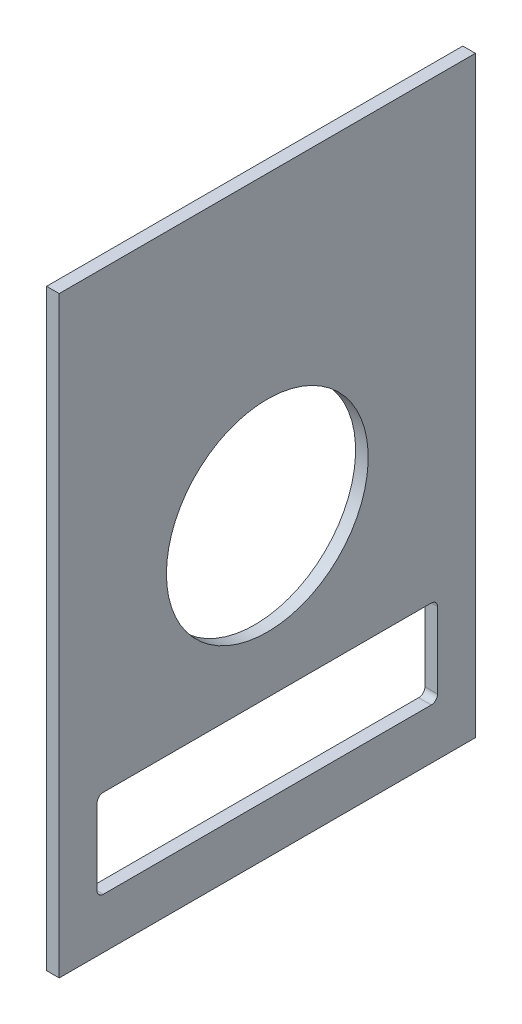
ISO-10303-21;
HEADER;
FILE_DESCRIPTION(('STEP AP214'),'2;1');
FILE_NAME('part.step','',(''),(''),'','','');
FILE_SCHEMA(('AUTOMOTIVE_DESIGN { 1 0 10303 214 1 1 1 1 }'));
ENDSEC;
DATA;
#1=APPLICATION_CONTEXT('core data for automotive mechanical design processes');
#2=APPLICATION_PROTOCOL_DEFINITION('international standard','automotive_design',2000,#1);
#3=PRODUCT_CONTEXT('',#1,'mechanical');
#4=PRODUCT('Part','Part','',(#3));
#5=PRODUCT_RELATED_PRODUCT_CATEGORY('part','',(#4));
#6=PRODUCT_DEFINITION_FORMATION('','',#4);
#7=PRODUCT_DEFINITION_CONTEXT('part definition',#1,'design');
#8=PRODUCT_DEFINITION('design','',#6,#7);
#9=PRODUCT_DEFINITION_SHAPE('','',#8);
#10=(LENGTH_UNIT() NAMED_UNIT(*) SI_UNIT(.MILLI.,.METRE.));
#11=(NAMED_UNIT(*) PLANE_ANGLE_UNIT() SI_UNIT($,.RADIAN.));
#12=(NAMED_UNIT(*) SI_UNIT($,.STERADIAN.) SOLID_ANGLE_UNIT());
#13=UNCERTAINTY_MEASURE_WITH_UNIT(LENGTH_MEASURE(1.E-05),#10,'distance_accuracy_value','');
#14=(GEOMETRIC_REPRESENTATION_CONTEXT(3) GLOBAL_UNCERTAINTY_ASSIGNED_CONTEXT((#13)) GLOBAL_UNIT_ASSIGNED_CONTEXT((#10,
#11,#12)) REPRESENTATION_CONTEXT('',''));
#15=CARTESIAN_POINT('',(0.,0.,0.));
#16=DIRECTION('',(0.,0.,1.));
#17=DIRECTION('',(1.,0.,0.));
#18=AXIS2_PLACEMENT_3D('',#15,#16,#17);
#19=CARTESIAN_POINT('',(12.7,298.45,209.55));
#20=DIRECTION('',(0.,0.,-1.));
#21=DIRECTION('',(0.,1.,0.));
#22=AXIS2_PLACEMENT_3D('',#19,#20,#21);
#23=PLANE('',#22);
#24=DIRECTION('',(0.,-1.,0.));
#25=VECTOR('',#24,1.);
#26=CARTESIAN_POINT('',(0.,298.45,209.55));
#27=LINE('',#26,#25);
#28=CARTESIAN_POINT('',(0.,298.45,209.55));
#29=VERTEX_POINT('',#28);
#30=CARTESIAN_POINT('',(0.,-298.45,209.55));
#31=VERTEX_POINT('',#30);
#32=EDGE_CURVE('E143',#29,#31,#27,.T.);
#33=ORIENTED_EDGE('',*,*,#32,.T.);
#34=DIRECTION('',(-1.,0.,0.));
#35=VECTOR('',#34,1.);
#36=CARTESIAN_POINT('',(12.7,-298.45,209.55));
#37=LINE('',#36,#35);
#38=CARTESIAN_POINT('',(12.7,-298.45,209.55));
#39=VERTEX_POINT('',#38);
#40=EDGE_CURVE('E124',#39,#31,#37,.T.);
#41=ORIENTED_EDGE('',*,*,#40,.F.);
#42=DIRECTION('',(0.,-1.,0.));
#43=VECTOR('',#42,1.);
#44=CARTESIAN_POINT('',(12.7,298.45,209.55));
#45=LINE('',#44,#43);
#46=CARTESIAN_POINT('',(12.7,298.45,209.55));
#47=VERTEX_POINT('',#46);
#48=EDGE_CURVE('E131',#47,#39,#45,.T.);
#49=ORIENTED_EDGE('',*,*,#48,.F.);
#50=DIRECTION('',(-1.,0.,0.));
#51=VECTOR('',#50,1.);
#52=CARTESIAN_POINT('',(12.7,298.45,209.55));
#53=LINE('',#52,#51);
#54=EDGE_CURVE('E219',#47,#29,#53,.T.);
#55=ORIENTED_EDGE('',*,*,#54,.T.);
#56=EDGE_LOOP('',(#33,#41,#49,#55));
#57=FACE_BOUND('',#56,.T.);
#58=ADVANCED_FACE('F31',(#57),#23,.F.);
#59=CARTESIAN_POINT('',(12.7,-298.45,209.55));
#60=DIRECTION('',(0.,1.,0.));
#61=DIRECTION('',(0.,0.,1.));
#62=AXIS2_PLACEMENT_3D('',#59,#60,#61);
#63=PLANE('',#62);
#64=DIRECTION('',(0.,0.,-1.));
#65=VECTOR('',#64,1.);
#66=CARTESIAN_POINT('',(0.,-298.45,209.55));
#67=LINE('',#66,#65);
#68=CARTESIAN_POINT('',(0.,-298.45,-209.55));
#69=VERTEX_POINT('',#68);
#70=EDGE_CURVE('E221',#31,#69,#67,.T.);
#71=ORIENTED_EDGE('',*,*,#70,.T.);
#72=DIRECTION('',(-1.,0.,0.));
#73=VECTOR('',#72,1.);
#74=CARTESIAN_POINT('',(12.7,-298.45,-209.55));
#75=LINE('',#74,#73);
#76=CARTESIAN_POINT('',(12.7,-298.45,-209.55));
#77=VERTEX_POINT('',#76);
#78=EDGE_CURVE('E127',#77,#69,#75,.T.);
#79=ORIENTED_EDGE('',*,*,#78,.F.);
#80=DIRECTION('',(0.,0.,-1.));
#81=VECTOR('',#80,1.);
#82=CARTESIAN_POINT('',(12.7,-298.45,209.55));
#83=LINE('',#82,#81);
#84=EDGE_CURVE('E120',#39,#77,#83,.T.);
#85=ORIENTED_EDGE('',*,*,#84,.F.);
#86=ORIENTED_EDGE('',*,*,#40,.T.);
#87=EDGE_LOOP('',(#71,#79,#85,#86));
#88=FACE_BOUND('',#87,.T.);
#89=ADVANCED_FACE('F122',(#88),#63,.F.);
#90=CARTESIAN_POINT('',(12.7,298.45,-209.55));
#91=DIRECTION('',(0.,0.,1.));
#92=DIRECTION('',(0.,-1.,0.));
#93=AXIS2_PLACEMENT_3D('',#90,#91,#92);
#94=PLANE('',#93);
#95=DIRECTION('',(0.,1.,0.));
#96=VECTOR('',#95,1.);
#97=CARTESIAN_POINT('',(0.,298.45,-209.55));
#98=LINE('',#97,#96);
#99=CARTESIAN_POINT('',(0.,298.45,-209.55));
#100=VERTEX_POINT('',#99);
#101=EDGE_CURVE('E223',#69,#100,#98,.T.);
#102=ORIENTED_EDGE('',*,*,#101,.T.);
#103=DIRECTION('',(-1.,0.,0.));
#104=VECTOR('',#103,1.);
#105=CARTESIAN_POINT('',(12.7,298.45,-209.55));
#106=LINE('',#105,#104);
#107=CARTESIAN_POINT('',(12.7,298.45,-209.55));
#108=VERTEX_POINT('',#107);
#109=EDGE_CURVE('E148',#108,#100,#106,.T.);
#110=ORIENTED_EDGE('',*,*,#109,.F.);
#111=DIRECTION('',(0.,1.,0.));
#112=VECTOR('',#111,1.);
#113=CARTESIAN_POINT('',(12.7,298.45,-209.55));
#114=LINE('',#113,#112);
#115=EDGE_CURVE('E130',#77,#108,#114,.T.);
#116=ORIENTED_EDGE('',*,*,#115,.F.);
#117=ORIENTED_EDGE('',*,*,#78,.T.);
#118=EDGE_LOOP('',(#102,#110,#116,#117));
#119=FACE_BOUND('',#118,.T.);
#120=ADVANCED_FACE('F233',(#119),#94,.F.);
#121=CARTESIAN_POINT('',(12.7,298.45,209.55));
#122=DIRECTION('',(0.,-1.,0.));
#123=DIRECTION('',(0.,0.,-1.));
#124=AXIS2_PLACEMENT_3D('',#121,#122,#123);
#125=PLANE('',#124);
#126=DIRECTION('',(0.,0.,1.));
#127=VECTOR('',#126,1.);
#128=CARTESIAN_POINT('',(0.,298.45,209.55));
#129=LINE('',#128,#127);
#130=EDGE_CURVE('E140',#100,#29,#129,.T.);
#131=ORIENTED_EDGE('',*,*,#130,.T.);
#132=ORIENTED_EDGE('',*,*,#54,.F.);
#133=DIRECTION('',(0.,0.,1.));
#134=VECTOR('',#133,1.);
#135=CARTESIAN_POINT('',(12.7,298.45,209.55));
#136=LINE('',#135,#134);
#137=EDGE_CURVE('E136',#108,#47,#136,.T.);
#138=ORIENTED_EDGE('',*,*,#137,.F.);
#139=ORIENTED_EDGE('',*,*,#109,.T.);
#140=EDGE_LOOP('',(#131,#132,#138,#139));
#141=FACE_BOUND('',#140,.T.);
#142=ADVANCED_FACE('F230',(#141),#125,.F.);
#143=CARTESIAN_POINT('',(12.7,-298.45,209.55));
#144=DIRECTION('',(1.,0.,0.));
#145=DIRECTION('',(0.,0.,-1.));
#146=AXIS2_PLACEMENT_3D('',#143,#144,#145);
#147=PLANE('',#146);
#148=CARTESIAN_POINT('',(12.7,0.,0.));
#149=DIRECTION('',(-1.,0.,0.));
#150=DIRECTION('',(0.,0.,1.));
#151=AXIS2_PLACEMENT_3D('',#148,#149,#150);
#152=CIRCLE('',#151,101.6);
#153=CARTESIAN_POINT('',(12.7,0.,101.6));
#154=VERTEX_POINT('',#153);
#155=EDGE_CURVE('E194',#154,#154,#152,.T.);
#156=ORIENTED_EDGE('',*,*,#155,.T.);
#157=EDGE_LOOP('',(#156));
#158=FACE_BOUND('',#157,.T.);
#159=DIRECTION('',(0.,0.,-1.));
#160=VECTOR('',#159,1.);
#161=CARTESIAN_POINT('',(12.7,-158.75,-171.45));
#162=LINE('',#161,#160);
#163=CARTESIAN_POINT('',(12.7,-158.75,165.1));
#164=VERTEX_POINT('',#163);
#165=CARTESIAN_POINT('',(12.7,-158.75,-165.1));
#166=VERTEX_POINT('',#165);
#167=EDGE_CURVE('E203',#164,#166,#162,.T.);
#168=ORIENTED_EDGE('',*,*,#167,.T.);
#169=CARTESIAN_POINT('',(12.7,-165.1,-165.1));
#170=DIRECTION('',(1.,0.,0.));
#171=DIRECTION('',(0.,0.,-1.));
#172=AXIS2_PLACEMENT_3D('',#169,#170,#171);
#173=CIRCLE('',#172,6.35);
#174=CARTESIAN_POINT('',(12.7,-165.1,-171.45));
#175=VERTEX_POINT('',#174);
#176=EDGE_CURVE('E170',#166,#175,#173,.F.);
#177=ORIENTED_EDGE('',*,*,#176,.T.);
#178=DIRECTION('',(0.,-1.,0.));
#179=VECTOR('',#178,1.);
#180=CARTESIAN_POINT('',(12.7,-158.75,-171.45));
#181=LINE('',#180,#179);
#182=CARTESIAN_POINT('',(12.7,-241.3,-171.45));
#183=VERTEX_POINT('',#182);
#184=EDGE_CURVE('E200',#175,#183,#181,.T.);
#185=ORIENTED_EDGE('',*,*,#184,.T.);
#186=CARTESIAN_POINT('',(12.7,-241.3,-165.1));
#187=DIRECTION('',(1.,0.,0.));
#188=DIRECTION('',(0.,0.,-1.));
#189=AXIS2_PLACEMENT_3D('',#186,#187,#188);
#190=CIRCLE('',#189,6.35);
#191=CARTESIAN_POINT('',(12.7,-247.65,-165.1));
#192=VERTEX_POINT('',#191);
#193=EDGE_CURVE('E11',#183,#192,#190,.F.);
#194=ORIENTED_EDGE('',*,*,#193,.T.);
#195=DIRECTION('',(0.,0.,1.));
#196=VECTOR('',#195,1.);
#197=CARTESIAN_POINT('',(12.7,-247.65,-171.45));
#198=LINE('',#197,#196);
#199=CARTESIAN_POINT('',(12.7,-247.65,165.1));
#200=VERTEX_POINT('',#199);
#201=EDGE_CURVE('E197',#192,#200,#198,.T.);
#202=ORIENTED_EDGE('',*,*,#201,.T.);
#203=CARTESIAN_POINT('',(12.7,-241.3,165.1));
#204=DIRECTION('',(1.,0.,0.));
#205=DIRECTION('',(0.,0.,-1.));
#206=AXIS2_PLACEMENT_3D('',#203,#204,#205);
#207=CIRCLE('',#206,6.35);
#208=CARTESIAN_POINT('',(12.7,-241.3,171.45));
#209=VERTEX_POINT('',#208);
#210=EDGE_CURVE('E174',#200,#209,#207,.F.);
#211=ORIENTED_EDGE('',*,*,#210,.T.);
#212=DIRECTION('',(0.,1.,0.));
#213=VECTOR('',#212,1.);
#214=CARTESIAN_POINT('',(12.7,-158.75,171.45));
#215=LINE('',#214,#213);
#216=CARTESIAN_POINT('',(12.7,-165.1,171.45));
#217=VERTEX_POINT('',#216);
#218=EDGE_CURVE('E199',#209,#217,#215,.T.);
#219=ORIENTED_EDGE('',*,*,#218,.T.);
#220=CARTESIAN_POINT('',(12.7,-165.1,165.1));
#221=DIRECTION('',(1.,0.,0.));
#222=DIRECTION('',(0.,0.,-1.));
#223=AXIS2_PLACEMENT_3D('',#220,#221,#222);
#224=CIRCLE('',#223,6.35);
#225=EDGE_CURVE('E178',#217,#164,#224,.F.);
#226=ORIENTED_EDGE('',*,*,#225,.T.);
#227=EDGE_LOOP('',(#168,#177,#185,#194,#202,#211,#219,#226));
#228=FACE_BOUND('',#227,.T.);
#229=ORIENTED_EDGE('',*,*,#48,.T.);
#230=ORIENTED_EDGE('',*,*,#84,.T.);
#231=ORIENTED_EDGE('',*,*,#115,.T.);
#232=ORIENTED_EDGE('',*,*,#137,.T.);
#233=EDGE_LOOP('',(#229,#230,#231,#232));
#234=FACE_BOUND('',#233,.T.);
#235=ADVANCED_FACE('F134',(#158,#228,#234),#147,.T.);
#236=CARTESIAN_POINT('',(0.,-298.45,209.55));
#237=DIRECTION('',(1.,0.,0.));
#238=DIRECTION('',(0.,0.,-1.));
#239=AXIS2_PLACEMENT_3D('',#236,#237,#238);
#240=PLANE('',#239);
#241=CARTESIAN_POINT('',(0.,0.,0.));
#242=DIRECTION('',(-1.,0.,0.));
#243=DIRECTION('',(0.,0.,1.));
#244=AXIS2_PLACEMENT_3D('',#241,#242,#243);
#245=CIRCLE('',#244,101.6);
#246=CARTESIAN_POINT('',(0.,0.,101.6));
#247=VERTEX_POINT('',#246);
#248=EDGE_CURVE('E296',#247,#247,#245,.T.);
#249=ORIENTED_EDGE('',*,*,#248,.F.);
#250=EDGE_LOOP('',(#249));
#251=FACE_BOUND('',#250,.T.);
#252=DIRECTION('',(0.,0.,1.));
#253=VECTOR('',#252,1.);
#254=CARTESIAN_POINT('',(0.,-247.65,-171.45));
#255=LINE('',#254,#253);
#256=CARTESIAN_POINT('',(0.,-247.65,-165.1));
#257=VERTEX_POINT('',#256);
#258=CARTESIAN_POINT('',(0.,-247.65,165.1));
#259=VERTEX_POINT('',#258);
#260=EDGE_CURVE('E186',#257,#259,#255,.T.);
#261=ORIENTED_EDGE('',*,*,#260,.F.);
#262=CARTESIAN_POINT('',(0.,-241.3,-165.1));
#263=DIRECTION('',(1.,0.,0.));
#264=DIRECTION('',(0.,0.,-1.));
#265=AXIS2_PLACEMENT_3D('',#262,#263,#264);
#266=CIRCLE('',#265,6.35);
#267=CARTESIAN_POINT('',(0.,-241.3,-171.45));
#268=VERTEX_POINT('',#267);
#269=EDGE_CURVE('E39',#257,#268,#266,.T.);
#270=ORIENTED_EDGE('',*,*,#269,.T.);
#271=DIRECTION('',(0.,-1.,0.));
#272=VECTOR('',#271,1.);
#273=CARTESIAN_POINT('',(0.,-158.75,-171.45));
#274=LINE('',#273,#272);
#275=CARTESIAN_POINT('',(0.,-165.1,-171.45));
#276=VERTEX_POINT('',#275);
#277=EDGE_CURVE('E185',#276,#268,#274,.T.);
#278=ORIENTED_EDGE('',*,*,#277,.F.);
#279=CARTESIAN_POINT('',(0.,-165.1,-165.1));
#280=DIRECTION('',(1.,0.,0.));
#281=DIRECTION('',(0.,0.,-1.));
#282=AXIS2_PLACEMENT_3D('',#279,#280,#281);
#283=CIRCLE('',#282,6.35);
#284=CARTESIAN_POINT('',(0.,-158.75,-165.1));
#285=VERTEX_POINT('',#284);
#286=EDGE_CURVE('E168',#276,#285,#283,.T.);
#287=ORIENTED_EDGE('',*,*,#286,.T.);
#288=DIRECTION('',(0.,0.,-1.));
#289=VECTOR('',#288,1.);
#290=CARTESIAN_POINT('',(0.,-158.75,-171.45));
#291=LINE('',#290,#289);
#292=CARTESIAN_POINT('',(0.,-158.75,165.1));
#293=VERTEX_POINT('',#292);
#294=EDGE_CURVE('E205',#293,#285,#291,.T.);
#295=ORIENTED_EDGE('',*,*,#294,.F.);
#296=CARTESIAN_POINT('',(0.,-165.1,165.1));
#297=DIRECTION('',(1.,0.,0.));
#298=DIRECTION('',(0.,0.,-1.));
#299=AXIS2_PLACEMENT_3D('',#296,#297,#298);
#300=CIRCLE('',#299,6.35);
#301=CARTESIAN_POINT('',(0.,-165.1,171.45));
#302=VERTEX_POINT('',#301);
#303=EDGE_CURVE('E176',#293,#302,#300,.T.);
#304=ORIENTED_EDGE('',*,*,#303,.T.);
#305=DIRECTION('',(0.,1.,0.));
#306=VECTOR('',#305,1.);
#307=CARTESIAN_POINT('',(0.,-158.75,171.45));
#308=LINE('',#307,#306);
#309=CARTESIAN_POINT('',(0.,-241.3,171.45));
#310=VERTEX_POINT('',#309);
#311=EDGE_CURVE('E212',#310,#302,#308,.T.);
#312=ORIENTED_EDGE('',*,*,#311,.F.);
#313=CARTESIAN_POINT('',(0.,-241.3,165.1));
#314=DIRECTION('',(1.,0.,0.));
#315=DIRECTION('',(0.,0.,-1.));
#316=AXIS2_PLACEMENT_3D('',#313,#314,#315);
#317=CIRCLE('',#316,6.35);
#318=EDGE_CURVE('E172',#310,#259,#317,.T.);
#319=ORIENTED_EDGE('',*,*,#318,.T.);
#320=EDGE_LOOP('',(#261,#270,#278,#287,#295,#304,#312,#319));
#321=FACE_BOUND('',#320,.T.);
#322=ORIENTED_EDGE('',*,*,#32,.F.);
#323=ORIENTED_EDGE('',*,*,#130,.F.);
#324=ORIENTED_EDGE('',*,*,#101,.F.);
#325=ORIENTED_EDGE('',*,*,#70,.F.);
#326=EDGE_LOOP('',(#322,#323,#324,#325));
#327=FACE_BOUND('',#326,.T.);
#328=ADVANCED_FACE('F183',(#251,#321,#327),#240,.F.);
#329=CARTESIAN_POINT('',(12.7,-158.75,-171.45));
#330=DIRECTION('',(0.,0.,-1.));
#331=DIRECTION('',(-1.,0.,0.));
#332=AXIS2_PLACEMENT_3D('',#329,#330,#331);
#333=PLANE('',#332);
#334=ORIENTED_EDGE('',*,*,#184,.F.);
#335=DIRECTION('',(-1.,0.,0.));
#336=VECTOR('',#335,1.);
#337=CARTESIAN_POINT('',(0.,-165.1,-171.45));
#338=LINE('',#337,#336);
#339=EDGE_CURVE('E146',#175,#276,#338,.T.);
#340=ORIENTED_EDGE('',*,*,#339,.T.);
#341=ORIENTED_EDGE('',*,*,#277,.T.);
#342=DIRECTION('',(-1.,0.,0.));
#343=VECTOR('',#342,1.);
#344=CARTESIAN_POINT('',(12.7,-241.3,-171.45));
#345=LINE('',#344,#343);
#346=EDGE_CURVE('E144',#268,#183,#345,.F.);
#347=ORIENTED_EDGE('',*,*,#346,.T.);
#348=EDGE_LOOP('',(#334,#340,#341,#347));
#349=FACE_BOUND('',#348,.T.);
#350=ADVANCED_FACE('F192',(#349),#333,.F.);
#351=CARTESIAN_POINT('',(12.7,-158.75,-171.45));
#352=DIRECTION('',(0.,1.,0.));
#353=DIRECTION('',(0.,0.,1.));
#354=AXIS2_PLACEMENT_3D('',#351,#352,#353);
#355=PLANE('',#354);
#356=ORIENTED_EDGE('',*,*,#294,.T.);
#357=DIRECTION('',(-1.,0.,0.));
#358=VECTOR('',#357,1.);
#359=CARTESIAN_POINT('',(12.7,-158.75,-165.1));
#360=LINE('',#359,#358);
#361=EDGE_CURVE('E157',#285,#166,#360,.F.);
#362=ORIENTED_EDGE('',*,*,#361,.T.);
#363=ORIENTED_EDGE('',*,*,#167,.F.);
#364=DIRECTION('',(-1.,0.,0.));
#365=VECTOR('',#364,1.);
#366=CARTESIAN_POINT('',(0.,-158.75,165.1));
#367=LINE('',#366,#365);
#368=EDGE_CURVE('E154',#164,#293,#367,.T.);
#369=ORIENTED_EDGE('',*,*,#368,.T.);
#370=EDGE_LOOP('',(#356,#362,#363,#369));
#371=FACE_BOUND('',#370,.T.);
#372=ADVANCED_FACE('F268',(#371),#355,.F.);
#373=CARTESIAN_POINT('',(12.7,-158.75,171.45));
#374=DIRECTION('',(0.,0.,1.));
#375=DIRECTION('',(1.,0.,0.));
#376=AXIS2_PLACEMENT_3D('',#373,#374,#375);
#377=PLANE('',#376);
#378=ORIENTED_EDGE('',*,*,#218,.F.);
#379=DIRECTION('',(-1.,0.,0.));
#380=VECTOR('',#379,1.);
#381=CARTESIAN_POINT('',(0.,-241.3,171.45));
#382=LINE('',#381,#380);
#383=EDGE_CURVE('E161',#209,#310,#382,.T.);
#384=ORIENTED_EDGE('',*,*,#383,.T.);
#385=ORIENTED_EDGE('',*,*,#311,.T.);
#386=DIRECTION('',(-1.,0.,0.));
#387=VECTOR('',#386,1.);
#388=CARTESIAN_POINT('',(12.7,-165.1,171.45));
#389=LINE('',#388,#387);
#390=EDGE_CURVE('E159',#302,#217,#389,.F.);
#391=ORIENTED_EDGE('',*,*,#390,.T.);
#392=EDGE_LOOP('',(#378,#384,#385,#391));
#393=FACE_BOUND('',#392,.T.);
#394=ADVANCED_FACE('F273',(#393),#377,.F.);
#395=CARTESIAN_POINT('',(12.7,-247.65,-171.45));
#396=DIRECTION('',(0.,-1.,0.));
#397=DIRECTION('',(0.,0.,-1.));
#398=AXIS2_PLACEMENT_3D('',#395,#396,#397);
#399=PLANE('',#398);
#400=ORIENTED_EDGE('',*,*,#260,.T.);
#401=DIRECTION('',(-1.,0.,0.));
#402=VECTOR('',#401,1.);
#403=CARTESIAN_POINT('',(12.7,-247.65,165.1));
#404=LINE('',#403,#402);
#405=EDGE_CURVE('E46',#259,#200,#404,.F.);
#406=ORIENTED_EDGE('',*,*,#405,.T.);
#407=ORIENTED_EDGE('',*,*,#201,.F.);
#408=DIRECTION('',(-1.,0.,0.));
#409=VECTOR('',#408,1.);
#410=CARTESIAN_POINT('',(0.,-247.65,-165.1));
#411=LINE('',#410,#409);
#412=EDGE_CURVE('E164',#192,#257,#411,.T.);
#413=ORIENTED_EDGE('',*,*,#412,.T.);
#414=EDGE_LOOP('',(#400,#406,#407,#413));
#415=FACE_BOUND('',#414,.T.);
#416=ADVANCED_FACE('F196',(#415),#399,.F.);
#417=CARTESIAN_POINT('',(12.7,0.,0.));
#418=DIRECTION('',(-1.,0.,0.));
#419=DIRECTION('',(0.,0.,1.));
#420=AXIS2_PLACEMENT_3D('',#417,#418,#419);
#421=CYLINDRICAL_SURFACE('',#420,101.6);
#422=ORIENTED_EDGE('',*,*,#155,.F.);
#423=EDGE_LOOP('',(#422));
#424=FACE_BOUND('',#423,.T.);
#425=ORIENTED_EDGE('',*,*,#248,.T.);
#426=EDGE_LOOP('',(#425));
#427=FACE_BOUND('',#426,.T.);
#428=ADVANCED_FACE('F251',(#424,#427),#421,.F.);
#429=CARTESIAN_POINT('',(12.7,-165.1,-165.1));
#430=DIRECTION('',(1.,0.,0.));
#431=DIRECTION('',(0.,0.,-1.));
#432=AXIS2_PLACEMENT_3D('',#429,#430,#431);
#433=CYLINDRICAL_SURFACE('',#432,6.35);
#434=ORIENTED_EDGE('',*,*,#176,.F.);
#435=ORIENTED_EDGE('',*,*,#361,.F.);
#436=ORIENTED_EDGE('',*,*,#286,.F.);
#437=ORIENTED_EDGE('',*,*,#339,.F.);
#438=EDGE_LOOP('',(#434,#435,#436,#437));
#439=FACE_BOUND('',#438,.T.);
#440=ADVANCED_FACE('F247',(#439),#433,.F.);
#441=CARTESIAN_POINT('',(12.7,-241.3,165.1));
#442=DIRECTION('',(1.,0.,0.));
#443=DIRECTION('',(0.,0.,-1.));
#444=AXIS2_PLACEMENT_3D('',#441,#442,#443);
#445=CYLINDRICAL_SURFACE('',#444,6.35);
#446=ORIENTED_EDGE('',*,*,#210,.F.);
#447=ORIENTED_EDGE('',*,*,#405,.F.);
#448=ORIENTED_EDGE('',*,*,#318,.F.);
#449=ORIENTED_EDGE('',*,*,#383,.F.);
#450=EDGE_LOOP('',(#446,#447,#448,#449));
#451=FACE_BOUND('',#450,.T.);
#452=ADVANCED_FACE('F250',(#451),#445,.F.);
#453=CARTESIAN_POINT('',(12.7,-165.1,165.1));
#454=DIRECTION('',(1.,0.,0.));
#455=DIRECTION('',(0.,0.,-1.));
#456=AXIS2_PLACEMENT_3D('',#453,#454,#455);
#457=CYLINDRICAL_SURFACE('',#456,6.35);
#458=ORIENTED_EDGE('',*,*,#225,.F.);
#459=ORIENTED_EDGE('',*,*,#390,.F.);
#460=ORIENTED_EDGE('',*,*,#303,.F.);
#461=ORIENTED_EDGE('',*,*,#368,.F.);
#462=EDGE_LOOP('',(#458,#459,#460,#461));
#463=FACE_BOUND('',#462,.T.);
#464=ADVANCED_FACE('F254',(#463),#457,.F.);
#465=CARTESIAN_POINT('',(12.7,-241.3,-165.1));
#466=DIRECTION('',(1.,0.,0.));
#467=DIRECTION('',(0.,0.,-1.));
#468=AXIS2_PLACEMENT_3D('',#465,#466,#467);
#469=CYLINDRICAL_SURFACE('',#468,6.35);
#470=ORIENTED_EDGE('',*,*,#193,.F.);
#471=ORIENTED_EDGE('',*,*,#346,.F.);
#472=ORIENTED_EDGE('',*,*,#269,.F.);
#473=ORIENTED_EDGE('',*,*,#412,.F.);
#474=EDGE_LOOP('',(#470,#471,#472,#473));
#475=FACE_BOUND('',#474,.T.);
#476=ADVANCED_FACE('F33',(#475),#469,.F.);
#477=CLOSED_SHELL('',(#58,#89,#120,#142,#235,#328,#350,#372,#394,#416,#428,#440,#452,#464,#476));
#478=MANIFOLD_SOLID_BREP('B2',#477);
#479=ADVANCED_BREP_SHAPE_REPRESENTATION('',(#18,#478),#14);
#480=SHAPE_DEFINITION_REPRESENTATION(#9,#479);
ENDSEC;
END-ISO-10303-21;
